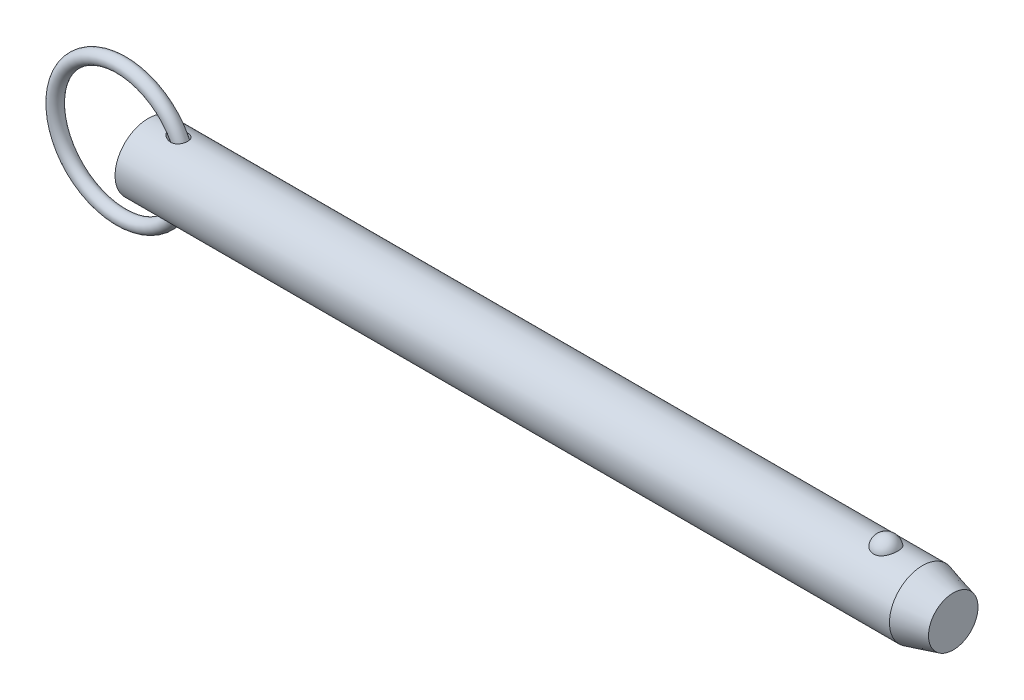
ISO-10303-21;
HEADER;
FILE_DESCRIPTION(('STEP AP214'),'2;1');
FILE_NAME('part.step','',(''),(''),'','','');
FILE_SCHEMA(('AUTOMOTIVE_DESIGN { 1 0 10303 214 1 1 1 1 }'));
ENDSEC;
DATA;
#1=APPLICATION_CONTEXT('core data for automotive mechanical design processes');
#2=APPLICATION_PROTOCOL_DEFINITION('international standard','automotive_design',2000,#1);
#3=PRODUCT_CONTEXT('',#1,'mechanical');
#4=PRODUCT('Part','Part','',(#3));
#5=PRODUCT_RELATED_PRODUCT_CATEGORY('part','',(#4));
#6=PRODUCT_DEFINITION_FORMATION('','',#4);
#7=PRODUCT_DEFINITION_CONTEXT('part definition',#1,'design');
#8=PRODUCT_DEFINITION('design','',#6,#7);
#9=PRODUCT_DEFINITION_SHAPE('','',#8);
#10=(LENGTH_UNIT() NAMED_UNIT(*) SI_UNIT(.MILLI.,.METRE.));
#11=(NAMED_UNIT(*) PLANE_ANGLE_UNIT() SI_UNIT($,.RADIAN.));
#12=(NAMED_UNIT(*) SI_UNIT($,.STERADIAN.) SOLID_ANGLE_UNIT());
#13=UNCERTAINTY_MEASURE_WITH_UNIT(LENGTH_MEASURE(1.E-05),#10,'distance_accuracy_value','');
#14=(GEOMETRIC_REPRESENTATION_CONTEXT(3) GLOBAL_UNCERTAINTY_ASSIGNED_CONTEXT((#13)) GLOBAL_UNIT_ASSIGNED_CONTEXT((#10,
#11,#12)) REPRESENTATION_CONTEXT('',''));
#15=CARTESIAN_POINT('',(0.,0.,0.));
#16=DIRECTION('',(0.,0.,1.));
#17=DIRECTION('',(1.,0.,0.));
#18=AXIS2_PLACEMENT_3D('',#15,#16,#17);
#19=CARTESIAN_POINT('',(-6.46799987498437,0.,0.));
#20=DIRECTION('',(0.,0.,1.));
#21=DIRECTION('',(1.,0.,0.));
#22=AXIS2_PLACEMENT_3D('',#19,#20,#21);
#23=TOROIDAL_SURFACE('',#22,15.875,1.588);
#24=CARTESIAN_POINT('',(10.9950001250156,0.,0.));
#25=VERTEX_POINT('',#24);
#26=VERTEX_LOOP('',#25);
#27=FACE_BOUND('',#26,.T.);
#28=ADVANCED_FACE('P0_F12',(#27),#23,.T.);
#29=CLOSED_SHELL('',(#28));
#30=MANIFOLD_SOLID_BREP('P0_B1',#29);
#31=CARTESIAN_POINT('',(0.,0.,0.));
#32=DIRECTION('',(1.,0.,0.));
#33=DIRECTION('',(0.,0.,-1.));
#34=AXIS2_PLACEMENT_3D('',#31,#32,#33);
#35=CYLINDRICAL_SURFACE('',#34,7.94);
#36=CARTESIAN_POINT('',(4.99454278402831,7.92831028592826,-0.430692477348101));
#37=CARTESIAN_POINT('',(5.02621962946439,7.92271974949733,-0.533554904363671));
#38=CARTESIAN_POINT('',(5.06869972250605,7.91528872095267,-0.633052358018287));
#39=CARTESIAN_POINT('',(5.17094751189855,7.89785690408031,-0.822566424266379));
#40=CARTESIAN_POINT('',(5.23077290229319,7.88784755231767,-0.912550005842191));
#41=CARTESIAN_POINT('',(5.37866013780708,7.8639674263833,-1.10117829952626));
#42=CARTESIAN_POINT('',(5.47004908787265,7.84973599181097,-1.19714712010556));
#43=CARTESIAN_POINT('',(5.66695490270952,7.82090787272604,-1.37293476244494));
#44=CARTESIAN_POINT('',(5.77247743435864,7.80631104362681,-1.45274707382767));
#45=CARTESIAN_POINT('',(5.99604254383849,7.77793596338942,-1.59776875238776));
#46=CARTESIAN_POINT('',(6.11428384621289,7.76417836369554,-1.66267404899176));
#47=CARTESIAN_POINT('',(6.35882685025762,7.73912410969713,-1.77564129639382));
#48=CARTESIAN_POINT('',(6.48513256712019,7.72782869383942,-1.82369477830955));
#49=CARTESIAN_POINT('',(6.76898453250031,7.70705630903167,-1.90977520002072));
#50=CARTESIAN_POINT('',(6.92778004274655,7.69837706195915,-1.94395681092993));
#51=CARTESIAN_POINT('',(7.24915504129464,7.6881294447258,-1.98412381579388));
#52=CARTESIAN_POINT('',(7.41173039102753,7.68655363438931,-1.99013871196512));
#53=CARTESIAN_POINT('',(7.697714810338,7.69094561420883,-1.97306069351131));
#54=CARTESIAN_POINT('',(7.82153338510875,7.69526202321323,-1.95634328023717));
#55=CARTESIAN_POINT('',(8.06460511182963,7.70859273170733,-1.90314615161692));
#56=CARTESIAN_POINT('',(8.18386164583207,7.7176034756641,-1.86668139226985));
#57=CARTESIAN_POINT('',(8.41450663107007,7.73959050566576,-1.77331230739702));
#58=CARTESIAN_POINT('',(8.52585042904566,7.75258738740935,-1.71630154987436));
#59=CARTESIAN_POINT('',(8.73575290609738,7.7809705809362,-1.58263416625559));
#60=CARTESIAN_POINT('',(8.83431445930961,7.7963563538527,-1.50598196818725));
#61=CARTESIAN_POINT('',(9.00639839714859,7.8259635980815,-1.34315626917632));
#62=CARTESIAN_POINT('',(9.08139772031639,7.84016008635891,-1.25853389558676));
#63=CARTESIAN_POINT('',(9.21545590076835,7.86710959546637,-1.07729126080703));
#64=CARTESIAN_POINT('',(9.27451869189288,7.87986297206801,-0.980673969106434));
#65=CARTESIAN_POINT('',(9.37315031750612,7.90198817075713,-0.782161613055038));
#66=CARTESIAN_POINT('',(9.41336512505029,7.91146854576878,-0.68059867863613));
#67=CARTESIAN_POINT('',(9.47650914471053,7.92664976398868,-0.471967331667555));
#68=CARTESIAN_POINT('',(9.49943917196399,7.93235078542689,-0.364899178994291));
#69=CARTESIAN_POINT('',(9.5274466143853,7.93934369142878,-0.14863226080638));
#70=CARTESIAN_POINT('',(9.53257574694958,7.9406483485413,-0.0394405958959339));
#71=CARTESIAN_POINT('',(9.52501411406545,7.93874464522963,0.178286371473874));
#72=CARTESIAN_POINT('',(9.51232314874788,7.93553623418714,0.286821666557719));
#73=CARTESIAN_POINT('',(9.46937875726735,7.92494527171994,0.500278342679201));
#74=CARTESIAN_POINT('',(9.43910562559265,7.9175580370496,0.605195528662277));
#75=CARTESIAN_POINT('',(9.36168926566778,7.8994090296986,0.808294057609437));
#76=CARTESIAN_POINT('',(9.3145467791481,7.88864740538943,0.906475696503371));
#77=CARTESIAN_POINT('',(9.20464679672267,7.86494645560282,1.09319438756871));
#78=CARTESIAN_POINT('',(9.14191093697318,7.85201015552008,1.18174456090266));
#79=CARTESIAN_POINT('',(9.00249124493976,7.82536913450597,1.34692675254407));
#80=CARTESIAN_POINT('',(8.92580850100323,7.81166447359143,1.42355969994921));
#81=CARTESIAN_POINT('',(8.76033130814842,7.78490157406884,1.56333296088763));
#82=CARTESIAN_POINT('',(8.67148512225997,7.77184644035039,1.62641250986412));
#83=CARTESIAN_POINT('',(8.48457694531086,7.74778101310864,1.73744892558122));
#84=CARTESIAN_POINT('',(8.38651410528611,7.73677090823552,1.78540439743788));
#85=CARTESIAN_POINT('',(8.18013312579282,7.71742695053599,1.86728938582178));
#86=CARTESIAN_POINT('',(8.07156725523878,7.7092102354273,1.90061897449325));
#87=CARTESIAN_POINT('',(7.85050876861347,7.6966502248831,1.95085652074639));
#88=CARTESIAN_POINT('',(7.73801453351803,7.69230854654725,1.967757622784));
#89=CARTESIAN_POINT('',(7.50002163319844,7.6873799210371,1.98693391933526));
#90=CARTESIAN_POINT('',(7.37438052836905,7.68722739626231,1.98751701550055));
#91=CARTESIAN_POINT('',(7.12435864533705,7.69142268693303,1.97121025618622));
#92=CARTESIAN_POINT('',(6.99997834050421,7.6957721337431,1.9543140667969));
#93=CARTESIAN_POINT('',(6.73521978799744,7.70925573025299,1.90049277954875));
#94=CARTESIAN_POINT('',(6.59543541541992,7.71903968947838,1.86081454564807));
#95=CARTESIAN_POINT('',(6.32319848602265,7.74233460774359,1.76138158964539));
#96=CARTESIAN_POINT('',(6.19076082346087,7.75585282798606,1.7015877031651));
#97=CARTESIAN_POINT('',(5.99269110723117,7.7785835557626,1.59336057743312));
#98=CARTESIAN_POINT('',(5.92332049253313,7.78707101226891,1.55151799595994));
#99=CARTESIAN_POINT('',(5.78862576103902,7.80440479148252,1.46183267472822));
#100=CARTESIAN_POINT('',(5.72330291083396,7.81325122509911,1.41398807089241));
#101=CARTESIAN_POINT('',(5.53492618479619,7.83980388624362,1.26162857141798));
#102=CARTESIAN_POINT('',(5.41884115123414,7.85759887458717,1.14795556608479));
#103=CARTESIAN_POINT('',(5.25731156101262,7.88350844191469,0.948390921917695));
#104=CARTESIAN_POINT('',(5.20241173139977,7.89260196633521,0.87019982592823));
#105=CARTESIAN_POINT('',(5.10541071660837,7.90897737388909,0.70602680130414));
#106=CARTESIAN_POINT('',(5.06329682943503,7.91626105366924,0.620052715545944));
#107=CARTESIAN_POINT('',(4.99458837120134,7.92827352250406,0.440665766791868));
#108=CARTESIAN_POINT('',(4.96816655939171,7.93297382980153,0.347182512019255));
#109=CARTESIAN_POINT('',(4.94275291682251,7.93751024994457,0.204498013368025));
#110=CARTESIAN_POINT('',(4.93665149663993,7.9386033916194,0.156529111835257));
#111=CARTESIAN_POINT('',(4.92932198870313,7.93991739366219,0.0602142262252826));
#112=CARTESIAN_POINT('',(4.92809242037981,7.94013851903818,0.011868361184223));
#113=CARTESIAN_POINT('',(4.93104052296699,7.93960920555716,-0.103241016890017));
#114=CARTESIAN_POINT('',(4.93747289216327,7.93845361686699,-0.169956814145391));
#115=CARTESIAN_POINT('',(4.95939910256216,7.93453812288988,-0.301777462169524));
#116=CARTESIAN_POINT('',(4.97489225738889,7.9317783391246,-0.36688243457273));
#117=CARTESIAN_POINT('',(4.99454278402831,7.92831028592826,-0.430692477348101));
#118=B_SPLINE_CURVE_WITH_KNOTS('',3,(#36,#37,#38,#39,#40,#41,#42,#43,#44,#45,#46,#47,#48,#49,
#50,#51,#52,#53,#54,#55,#56,#57,#58,#59,#60,#61,#62,#63,#64,#65,#66,#67,#68,#69,#70,#71,#72,#73,
#74,#75,#76,#77,#78,#79,#80,#81,#82,#83,#84,#85,#86,#87,#88,#89,#90,#91,#92,#93,#94,#95,#96,#97,
#98,#99,#100,#101,#102,#103,#104,#105,#106,#107,#108,#109,#110,#111,#112,#113,#114,#115,#116,
#117),.UNSPECIFIED.,.T.,.F.,(4,2,2,2,2,2,2,2,2,2,2,2,2,2,2,2,2,2,2,2,2,2,2,2,2,2,2,2,2,2,2,2,2,
2,2,2,2,2,2,2,4),(0.,0.323000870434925,0.647088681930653,1.04479679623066,1.4426648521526,
1.84804279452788,2.25362416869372,2.73917777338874,3.2242226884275,3.59772765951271,
3.97095014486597,4.34613445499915,4.72123425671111,5.06140749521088,5.40149668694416,
5.72887751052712,6.05624289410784,6.38265637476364,6.70907351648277,7.03585720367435,
7.36262652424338,7.68894495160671,8.01523792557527,8.34296459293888,8.67072147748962,
9.01089033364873,9.35120108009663,9.72668268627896,10.1023004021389,10.5375309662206,
10.9736138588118,11.2176803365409,11.461822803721,11.9480055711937,12.2349837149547,
12.5216758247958,12.8114683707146,12.9563497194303,13.1011870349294,13.3015737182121,
13.5019452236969),.UNSPECIFIED.);
#119=CARTESIAN_POINT('',(4.99454278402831,7.92831028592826,-0.430692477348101));
#120=VERTEX_POINT('',#119);
#121=EDGE_CURVE('P1_E40',#120,#120,#118,.T.);
#122=ORIENTED_EDGE('',*,*,#121,.T.);
#123=EDGE_LOOP('',(#122));
#124=FACE_BOUND('',#123,.T.);
#125=CARTESIAN_POINT('',(186.271879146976,0.,0.));
#126=DIRECTION('',(1.,0.,0.));
#127=DIRECTION('',(0.,0.,-1.));
#128=AXIS2_PLACEMENT_3D('',#125,#126,#127);
#129=CIRCLE('',#128,7.94);
#130=CARTESIAN_POINT('',(186.271879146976,0.,-7.94));
#131=VERTEX_POINT('',#130);
#132=EDGE_CURVE('P1_E25',#131,#131,#129,.T.);
#133=ORIENTED_EDGE('',*,*,#132,.F.);
#134=EDGE_LOOP('',(#133));
#135=FACE_BOUND('',#134,.T.);
#136=CARTESIAN_POINT('',(0.,0.,0.));
#137=DIRECTION('',(1.,0.,0.));
#138=DIRECTION('',(0.,0.,-1.));
#139=AXIS2_PLACEMENT_3D('',#136,#137,#138);
#140=CIRCLE('',#139,7.94);
#141=CARTESIAN_POINT('',(0.,0.,-7.94));
#142=VERTEX_POINT('',#141);
#143=EDGE_CURVE('P1_E9',#142,#142,#140,.T.);
#144=ORIENTED_EDGE('',*,*,#143,.T.);
#145=EDGE_LOOP('',(#144));
#146=FACE_BOUND('',#145,.T.);
#147=CARTESIAN_POINT('',(177.464907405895,7.37767842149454,2.93486986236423));
#148=CARTESIAN_POINT('',(177.312749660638,7.3776732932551,2.93487505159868));
#149=CARTESIAN_POINT('',(177.160632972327,7.38258419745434,2.92262454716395));
#150=CARTESIAN_POINT('',(176.860928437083,7.40163229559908,2.87404196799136));
#151=CARTESIAN_POINT('',(176.713339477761,7.41576720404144,2.83771585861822));
#152=CARTESIAN_POINT('',(176.427018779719,7.45161576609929,2.74218769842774));
#153=CARTESIAN_POINT('',(176.288274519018,7.47331841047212,2.68301886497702));
#154=CARTESIAN_POINT('',(176.022882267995,7.52194082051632,2.54350967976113));
#155=CARTESIAN_POINT('',(175.896236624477,7.54886159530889,2.46316523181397));
#156=CARTESIAN_POINT('',(175.654534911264,7.60594671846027,2.28090375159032));
#157=CARTESIAN_POINT('',(175.539906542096,7.63618114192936,2.17844211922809));
#158=CARTESIAN_POINT('',(175.328878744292,7.69614046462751,1.95608495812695));
#159=CARTESIAN_POINT('',(175.232482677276,7.72586526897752,1.83618622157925));
#160=CARTESIAN_POINT('',(175.055938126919,7.78314821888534,1.57628086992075));
#161=CARTESIAN_POINT('',(174.976707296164,7.81055035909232,1.43561546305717));
#162=CARTESIAN_POINT('',(174.841797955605,7.85879631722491,1.142363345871));
#163=CARTESIAN_POINT('',(174.786121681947,7.87963951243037,0.989775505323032));
#164=CARTESIAN_POINT('',(174.69881215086,7.91289645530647,0.674619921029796));
#165=CARTESIAN_POINT('',(174.66753090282,7.92518652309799,0.511941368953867));
#166=CARTESIAN_POINT('',(174.630975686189,7.93958930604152,0.183247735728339));
#167=CARTESIAN_POINT('',(174.625701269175,7.94170219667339,0.0172327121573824));
#168=CARTESIAN_POINT('',(174.641231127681,7.93554931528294,-0.312672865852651));
#169=CARTESIAN_POINT('',(174.661925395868,7.92732732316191,-0.476569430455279));
#170=CARTESIAN_POINT('',(174.72878655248,7.90141534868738,-0.798305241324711));
#171=CARTESIAN_POINT('',(174.774953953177,7.88372517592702,-0.956144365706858));
#172=CARTESIAN_POINT('',(174.891898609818,7.84066230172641,-1.26152073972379));
#173=CARTESIAN_POINT('',(174.962704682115,7.81528060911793,-1.40904568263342));
#174=CARTESIAN_POINT('',(175.127478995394,7.75948672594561,-1.68950598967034));
#175=CARTESIAN_POINT('',(175.221448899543,7.72907417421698,-1.82244030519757));
#176=CARTESIAN_POINT('',(175.430839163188,7.66640424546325,-2.07032792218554));
#177=CARTESIAN_POINT('',(175.546315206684,7.63414223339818,-2.18523308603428));
#178=CARTESIAN_POINT('',(175.7959006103,7.57149681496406,-2.39329737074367));
#179=CARTESIAN_POINT('',(175.930008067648,7.54111321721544,-2.48645870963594));
#180=CARTESIAN_POINT('',(176.210111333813,7.48650742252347,-2.64628132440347));
#181=CARTESIAN_POINT('',(176.355760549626,7.46215900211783,-2.71350554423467));
#182=CARTESIAN_POINT('',(176.657425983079,7.42171253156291,-2.82226614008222));
#183=CARTESIAN_POINT('',(176.813438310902,7.40561140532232,-2.86381209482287));
#184=CARTESIAN_POINT('',(177.122970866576,7.3842679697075,-2.9183907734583));
#185=CARTESIAN_POINT('',(177.276222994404,7.37852109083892,-2.93275024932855));
#186=CARTESIAN_POINT('',(177.583070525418,7.37700973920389,-2.93655208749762));
#187=CARTESIAN_POINT('',(177.736665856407,7.38124333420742,-2.92599927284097));
#188=CARTESIAN_POINT('',(178.034990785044,7.39890635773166,-2.88102897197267));
#189=CARTESIAN_POINT('',(178.179848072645,7.41205491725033,-2.84733999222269));
#190=CARTESIAN_POINT('',(178.46164329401,7.445801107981,-2.75788206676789));
#191=CARTESIAN_POINT('',(178.598580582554,7.46639934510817,-2.70211132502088));
#192=CARTESIAN_POINT('',(178.864061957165,7.51339098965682,-2.56858908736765));
#193=CARTESIAN_POINT('',(178.992354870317,7.53990200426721,-2.4903806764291));
#194=CARTESIAN_POINT('',(179.234244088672,7.59569503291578,-2.31462737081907));
#195=CARTESIAN_POINT('',(179.347837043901,7.6249776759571,-2.21707808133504));
#196=CARTESIAN_POINT('',(179.56322156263,7.68489473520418,-1.99982049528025));
#197=CARTESIAN_POINT('',(179.664148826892,7.71552419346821,-1.87925337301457));
#198=CARTESIAN_POINT('',(179.845186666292,7.77353016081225,-1.62268826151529));
#199=CARTESIAN_POINT('',(179.925293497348,7.80090608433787,-1.48668750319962));
#200=CARTESIAN_POINT('',(180.065361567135,7.85047992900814,-1.1981841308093));
#201=CARTESIAN_POINT('',(180.124587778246,7.87248183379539,-1.04529016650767));
#202=CARTESIAN_POINT('',(180.217982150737,7.90785114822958,-0.731080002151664));
#203=CARTESIAN_POINT('',(180.252149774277,7.92121837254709,-0.569763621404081));
#204=CARTESIAN_POINT('',(180.294795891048,7.93797834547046,-0.242812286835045));
#205=CARTESIAN_POINT('',(180.303204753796,7.94134405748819,-0.0771668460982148));
#206=CARTESIAN_POINT('',(180.293962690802,7.93767937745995,0.253276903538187));
#207=CARTESIAN_POINT('',(180.276312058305,7.93064910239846,0.418075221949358));
#208=CARTESIAN_POINT('',(180.215424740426,7.90695571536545,0.741525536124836));
#209=CARTESIAN_POINT('',(180.172281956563,7.8903279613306,0.900197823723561));
#210=CARTESIAN_POINT('',(180.06135358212,7.84916386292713,1.20759654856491));
#211=CARTESIAN_POINT('',(179.99356656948,7.82462706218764,1.35632241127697));
#212=CARTESIAN_POINT('',(179.834371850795,7.77006699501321,1.64032869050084));
#213=CARTESIAN_POINT('',(179.742861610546,7.74002008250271,1.7755471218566));
#214=CARTESIAN_POINT('',(179.538296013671,7.67774175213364,2.0280064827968));
#215=CARTESIAN_POINT('',(179.425241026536,7.64551037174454,2.14524772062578));
#216=CARTESIAN_POINT('',(179.180831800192,7.58265895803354,2.35778002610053));
#217=CARTESIAN_POINT('',(179.049583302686,7.5520309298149,2.45319004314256));
#218=CARTESIAN_POINT('',(178.771601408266,7.49579792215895,2.61999897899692));
#219=CARTESIAN_POINT('',(178.624867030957,7.47019326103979,2.69139637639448));
#220=CARTESIAN_POINT('',(178.312947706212,7.42622216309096,2.8105324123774));
#221=CARTESIAN_POINT('',(178.147220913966,7.40825002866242,2.85700910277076));
#222=CARTESIAN_POINT('',(177.809279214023,7.38398348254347,2.9191685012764));
#223=CARTESIAN_POINT('',(177.63706702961,7.3776842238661,2.93486399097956));
#224=CARTESIAN_POINT('',(177.464907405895,7.37767842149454,2.93486986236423));
#225=B_SPLINE_CURVE_WITH_KNOTS('',3,(#147,#148,#149,#150,#151,#152,#153,#154,#155,#156,#157,
#158,#159,#160,#161,#162,#163,#164,#165,#166,#167,#168,#169,#170,#171,#172,#173,#174,#175,#176,
#177,#178,#179,#180,#181,#182,#183,#184,#185,#186,#187,#188,#189,#190,#191,#192,#193,#194,#195,
#196,#197,#198,#199,#200,#201,#202,#203,#204,#205,#206,#207,#208,#209,#210,#211,#212,#213,#214,
#215,#216,#217,#218,#219,#220,#221,#222,#223,#224),.UNSPECIFIED.,.T.,.F.,(4,2,2,2,2,2,2,2,2,2,2,
2,2,2,2,2,2,2,2,2,2,2,2,2,2,2,2,2,2,2,2,2,2,2,2,2,2,2,4),(0.,0.45584132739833,0.911569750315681,
1.36663794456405,1.82179423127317,2.28978983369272,2.75787163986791,3.24685368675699,
3.73588214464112,4.23184282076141,4.72779494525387,5.22165321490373,5.71552141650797,
6.20996917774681,6.7044524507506,7.20023431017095,7.69596557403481,8.18023418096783,
8.66432203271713,9.12410697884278,9.58380291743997,10.0296503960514,10.4755341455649,
10.9312349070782,11.3870393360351,11.8654416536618,12.3439299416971,12.8378875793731,
13.3318558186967,13.8271581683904,14.3224549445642,14.8159385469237,15.3094506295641,
15.8051323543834,16.3008055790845,16.7937101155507,17.2866458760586,17.8026240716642,
18.3183879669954),.UNSPECIFIED.);
#226=CARTESIAN_POINT('',(177.464907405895,7.37767842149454,2.93486986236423));
#227=VERTEX_POINT('',#226);
#228=EDGE_CURVE('P1_E34',#227,#227,#225,.T.);
#229=ORIENTED_EDGE('',*,*,#228,.T.);
#230=EDGE_LOOP('',(#229));
#231=FACE_BOUND('',#230,.T.);
#232=CARTESIAN_POINT('',(4.99454278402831,-7.92831028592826,-0.430692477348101));
#233=CARTESIAN_POINT('',(4.97033227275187,-7.93258231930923,-0.352006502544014));
#234=CARTESIAN_POINT('',(4.95238785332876,-7.93578782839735,-0.271213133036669));
#235=CARTESIAN_POINT('',(4.93055628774,-7.93969351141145,-0.107590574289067));
#236=CARTESIAN_POINT('',(4.92668686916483,-7.9403905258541,-0.0247589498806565));
#237=CARTESIAN_POINT('',(4.9333808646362,-7.93918950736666,0.140249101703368));
#238=CARTESIAN_POINT('',(4.94393526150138,-7.93729309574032,0.222425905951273));
#239=CARTESIAN_POINT('',(4.97854187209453,-7.93113325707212,0.383746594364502));
#240=CARTESIAN_POINT('',(5.00259804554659,-7.92686913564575,0.462889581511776));
#241=CARTESIAN_POINT('',(5.06904511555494,-7.91526143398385,0.633278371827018));
#242=CARTESIAN_POINT('',(5.11430124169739,-7.90744739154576,0.723368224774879));
#243=CARTESIAN_POINT('',(5.21873327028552,-7.88988375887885,0.894880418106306));
#244=CARTESIAN_POINT('',(5.27793532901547,-7.88013053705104,0.976286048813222));
#245=CARTESIAN_POINT('',(5.42949971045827,-7.85602233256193,1.15646341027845));
#246=CARTESIAN_POINT('',(5.52624420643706,-7.84124381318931,1.25147911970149));
#247=CARTESIAN_POINT('',(5.73364751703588,-7.81163164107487,1.42469165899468));
#248=CARTESIAN_POINT('',(5.84432059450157,-7.79679794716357,1.50287102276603));
#249=CARTESIAN_POINT('',(6.07871104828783,-7.76824211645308,1.64418004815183));
#250=CARTESIAN_POINT('',(6.20267992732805,-7.75455572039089,1.70689813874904));
#251=CARTESIAN_POINT('',(6.45850163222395,-7.73013259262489,1.81429879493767));
#252=CARTESIAN_POINT('',(6.59035778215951,-7.71939711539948,1.85897369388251));
#253=CARTESIAN_POINT('',(6.88209177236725,-7.70072462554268,1.93500734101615));
#254=CARTESIAN_POINT('',(7.04295460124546,-7.69356120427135,1.96286607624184));
#255=CARTESIAN_POINT('',(7.36724421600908,-7.68676336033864,1.98935053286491));
#256=CARTESIAN_POINT('',(7.53066723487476,-7.68711875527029,1.98801578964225));
#257=CARTESIAN_POINT('',(7.81370255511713,-7.69496475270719,1.95735673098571));
#258=CARTESIAN_POINT('',(7.93413357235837,-7.70066491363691,1.93505220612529));
#259=CARTESIAN_POINT('',(8.16950597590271,-7.71642704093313,1.87121573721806));
#260=CARTESIAN_POINT('',(8.28445128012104,-7.72648584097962,1.82969774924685));
#261=CARTESIAN_POINT('',(8.50557964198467,-7.75006886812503,1.72707806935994));
#262=CARTESIAN_POINT('',(8.61171927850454,-7.76360905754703,1.66588583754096));
#263=CARTESIAN_POINT('',(8.810712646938,-7.79249659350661,1.52503518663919));
#264=CARTESIAN_POINT('',(8.90356827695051,-7.80784368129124,1.44537941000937));
#265=CARTESIAN_POINT('',(9.06550151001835,-7.83702302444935,1.27723027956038));
#266=CARTESIAN_POINT('',(9.1359139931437,-7.85087516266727,1.19002179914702));
#267=CARTESIAN_POINT('',(9.26060432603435,-7.87675706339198,1.00451336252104));
#268=CARTESIAN_POINT('',(9.31488561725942,-7.88878721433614,0.906215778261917));
#269=CARTESIAN_POINT('',(9.40446618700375,-7.90930761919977,0.70456335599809));
#270=CARTESIAN_POINT('',(9.44028687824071,-7.91789338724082,0.601449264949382));
#271=CARTESIAN_POINT('',(9.49451523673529,-7.93109531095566,0.390496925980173));
#272=CARTESIAN_POINT('',(9.51292345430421,-7.93571159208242,0.282658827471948));
#273=CARTESIAN_POINT('',(9.53189686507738,-7.94047189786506,0.0654759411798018));
#274=CARTESIAN_POINT('',(9.53248611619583,-7.94062195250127,-0.0438666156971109));
#275=CARTESIAN_POINT('',(9.51587068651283,-7.93644929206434,-0.26110665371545));
#276=CARTESIAN_POINT('',(9.49866585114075,-7.93212653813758,-0.369004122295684));
#277=CARTESIAN_POINT('',(9.44682594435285,-7.91946859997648,-0.58038072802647));
#278=CARTESIAN_POINT('',(9.412176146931,-7.91113002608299,-0.683856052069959));
#279=CARTESIAN_POINT('',(9.32626198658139,-7.89134774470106,-0.883337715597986));
#280=CARTESIAN_POINT('',(9.27499851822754,-7.87990420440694,-0.979344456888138));
#281=CARTESIAN_POINT('',(9.15725058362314,-7.8551872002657,-1.1610523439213));
#282=CARTESIAN_POINT('',(9.09078836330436,-7.84191642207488,-1.24676827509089));
#283=CARTESIAN_POINT('',(8.94443523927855,-7.81498501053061,-1.40574704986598));
#284=CARTESIAN_POINT('',(8.86454527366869,-7.80132440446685,-1.47901076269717));
#285=CARTESIAN_POINT('',(8.69307774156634,-7.77497848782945,-1.61181253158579));
#286=CARTESIAN_POINT('',(8.60142539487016,-7.76230033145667,-1.67125525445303));
#287=CARTESIAN_POINT('',(8.40957687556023,-7.73928987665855,-1.77477159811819));
#288=CARTESIAN_POINT('',(8.30937953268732,-7.72895790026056,-1.81884310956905));
#289=CARTESIAN_POINT('',(8.0986350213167,-7.71113842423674,-1.89300673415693));
#290=CARTESIAN_POINT('',(7.98782526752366,-7.70379913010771,-1.92238394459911));
#291=CARTESIAN_POINT('',(7.76294389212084,-7.69313871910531,-1.96460780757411));
#292=CARTESIAN_POINT('',(7.64887102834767,-7.68981915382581,-1.9774480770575));
#293=CARTESIAN_POINT('',(7.40716929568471,-7.68706358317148,-1.98813881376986));
#294=CARTESIAN_POINT('',(7.27945620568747,-7.68810537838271,-1.98414471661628));
#295=CARTESIAN_POINT('',(7.02593945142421,-7.6946815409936,-1.95847707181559));
#296=CARTESIAN_POINT('',(6.90013720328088,-7.7002190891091,-1.93679100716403));
#297=CARTESIAN_POINT('',(6.63265145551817,-7.71617635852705,-1.87230070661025));
#298=CARTESIAN_POINT('',(6.49169161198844,-7.72724102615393,-1.82664736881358));
#299=CARTESIAN_POINT('',(6.21840602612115,-7.75282261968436,-1.71482542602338));
#300=CARTESIAN_POINT('',(6.08608498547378,-7.76734140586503,-1.64864576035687));
#301=CARTESIAN_POINT('',(5.84453114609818,-7.7967744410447,-1.50297952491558));
#302=CARTESIAN_POINT('',(5.73429128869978,-7.81154606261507,-1.4251373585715));
#303=CARTESIAN_POINT('',(5.52761180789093,-7.84104229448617,-1.25271210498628));
#304=CARTESIAN_POINT('',(5.43116004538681,-7.85576693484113,-1.15814390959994));
#305=CARTESIAN_POINT('',(5.27970568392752,-7.87984260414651,-0.978603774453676));
#306=CARTESIAN_POINT('',(5.22040249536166,-7.88960721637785,-0.897319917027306));
#307=CARTESIAN_POINT('',(5.11583115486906,-7.90718602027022,-0.726171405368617));
#308=CARTESIAN_POINT('',(5.07050564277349,-7.9150081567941,-0.636343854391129));
#309=CARTESIAN_POINT('',(5.01937588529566,-7.92393751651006,-0.506165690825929));
#310=CARTESIAN_POINT('',(5.00622932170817,-7.926248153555,-0.468674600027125));
#311=CARTESIAN_POINT('',(4.99454278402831,-7.92831028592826,-0.430692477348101));
#312=B_SPLINE_CURVE_WITH_KNOTS('',3,(#232,#233,#234,#235,#236,#237,#238,#239,#240,#241,#242,
#243,#244,#245,#246,#247,#248,#249,#250,#251,#252,#253,#254,#255,#256,#257,#258,#259,#260,#261,
#262,#263,#264,#265,#266,#267,#268,#269,#270,#271,#272,#273,#274,#275,#276,#277,#278,#279,#280,
#281,#282,#283,#284,#285,#286,#287,#288,#289,#290,#291,#292,#293,#294,#295,#296,#297,#298,#299,
#300,#301,#302,#303,#304,#305,#306,#307,#308,#309,#310,#311),.UNSPECIFIED.,.T.,.F.,(4,2,2,2,2,2,
2,2,2,2,2,2,2,2,2,2,2,2,2,2,2,2,2,2,2,2,2,2,2,2,2,2,2,2,2,2,2,2,2,4),(0.,0.247186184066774,
0.494683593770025,0.742026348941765,0.989441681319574,1.29115800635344,1.59344478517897,
2.00047108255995,2.40791761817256,2.82525860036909,3.2427767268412,3.7304673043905,
4.21749746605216,4.58380730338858,4.94985148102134,5.31760488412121,5.68530568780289,
6.02244390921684,6.35951015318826,6.68644714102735,7.01337379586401,7.33985903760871,
7.66634711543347,7.9931112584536,8.31985780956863,8.64612913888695,8.97237768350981,
9.30081392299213,9.62929521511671,9.9724956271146,10.3158284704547,10.6977037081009,
11.0798493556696,11.523823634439,11.9680375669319,12.3738595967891,12.7793221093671,
13.0815405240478,13.3825016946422,13.5018197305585),.UNSPECIFIED.);
#313=CARTESIAN_POINT('',(4.99454278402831,-7.92831028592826,-0.430692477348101));
#314=VERTEX_POINT('',#313);
#315=EDGE_CURVE('P1_E17',#314,#314,#312,.T.);
#316=ORIENTED_EDGE('',*,*,#315,.T.);
#317=EDGE_LOOP('',(#316));
#318=FACE_BOUND('',#317,.T.);
#319=ADVANCED_FACE('P1_F13',(#124,#135,#146,#231,#318),#35,.T.);
#320=CARTESIAN_POINT('',(0.,0.,0.));
#321=DIRECTION('',(-1.,0.,0.));
#322=DIRECTION('',(0.,0.,1.));
#323=AXIS2_PLACEMENT_3D('',#320,#321,#322);
#324=PLANE('',#323);
#325=ORIENTED_EDGE('',*,*,#143,.F.);
#326=EDGE_LOOP('',(#325));
#327=FACE_BOUND('',#326,.T.);
#328=ADVANCED_FACE('P1_F15',(#327),#324,.T.);
#329=CARTESIAN_POINT('',(193.68,0.,0.));
#330=DIRECTION('',(-1.,0.,0.));
#331=DIRECTION('',(0.,0.,1.));
#332=AXIS2_PLACEMENT_3D('',#329,#330,#331);
#333=CONICAL_SURFACE('',#332,5.95500000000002,0.26179938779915);
#334=ORIENTED_EDGE('',*,*,#132,.T.);
#335=EDGE_LOOP('',(#334));
#336=FACE_BOUND('',#335,.T.);
#337=CARTESIAN_POINT('',(193.68,0.,0.));
#338=DIRECTION('',(1.,0.,0.));
#339=DIRECTION('',(0.,0.,-1.));
#340=AXIS2_PLACEMENT_3D('',#337,#338,#339);
#341=CIRCLE('',#340,5.95500000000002);
#342=CARTESIAN_POINT('',(193.68,0.,-5.95500000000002));
#343=VERTEX_POINT('',#342);
#344=EDGE_CURVE('P1_E30',#343,#343,#341,.T.);
#345=ORIENTED_EDGE('',*,*,#344,.F.);
#346=EDGE_LOOP('',(#345));
#347=FACE_BOUND('',#346,.T.);
#348=ADVANCED_FACE('P1_F55',(#336,#347),#333,.T.);
#349=CARTESIAN_POINT('',(193.68,5.95500000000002,0.));
#350=DIRECTION('',(1.,0.,0.));
#351=DIRECTION('',(0.,0.,-1.));
#352=AXIS2_PLACEMENT_3D('',#349,#350,#351);
#353=PLANE('',#352);
#354=ORIENTED_EDGE('',*,*,#344,.T.);
#355=EDGE_LOOP('',(#354));
#356=FACE_BOUND('',#355,.T.);
#357=ADVANCED_FACE('P1_F51',(#356),#353,.T.);
#358=CARTESIAN_POINT('',(177.464907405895,7.146,0.));
#359=DIRECTION('',(-1.,0.,0.));
#360=DIRECTION('',(0.,-1.,0.));
#361=AXIS2_PLACEMENT_3D('',#358,#359,#360);
#362=SPHERICAL_SURFACE('',#361,2.944);
#363=ORIENTED_EDGE('',*,*,#228,.F.);
#364=EDGE_LOOP('',(#363));
#365=FACE_BOUND('',#364,.T.);
#366=ADVANCED_FACE('P1_F46',(#365),#362,.T.);
#367=CARTESIAN_POINT('',(-6.46799987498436,0.,0.));
#368=DIRECTION('',(0.,0.,1.));
#369=DIRECTION('',(1.,0.,0.));
#370=AXIS2_PLACEMENT_3D('',#367,#368,#369);
#371=TOROIDAL_SURFACE('',#370,15.875,1.985);
#372=ORIENTED_EDGE('',*,*,#315,.F.);
#373=EDGE_LOOP('',(#372));
#374=FACE_BOUND('',#373,.T.);
#375=ORIENTED_EDGE('',*,*,#121,.F.);
#376=EDGE_LOOP('',(#375));
#377=FACE_BOUND('',#376,.T.);
#378=ADVANCED_FACE('P1_F50',(#374,#377),#371,.F.);
#379=CLOSED_SHELL('',(#319,#328,#348,#357,#366,#378));
#380=MANIFOLD_SOLID_BREP('P1_B1',#379);
#381=ADVANCED_BREP_SHAPE_REPRESENTATION('',(#18,#30,#380),#14);
#382=SHAPE_DEFINITION_REPRESENTATION(#9,#381);
ENDSEC;
END-ISO-10303-21;
